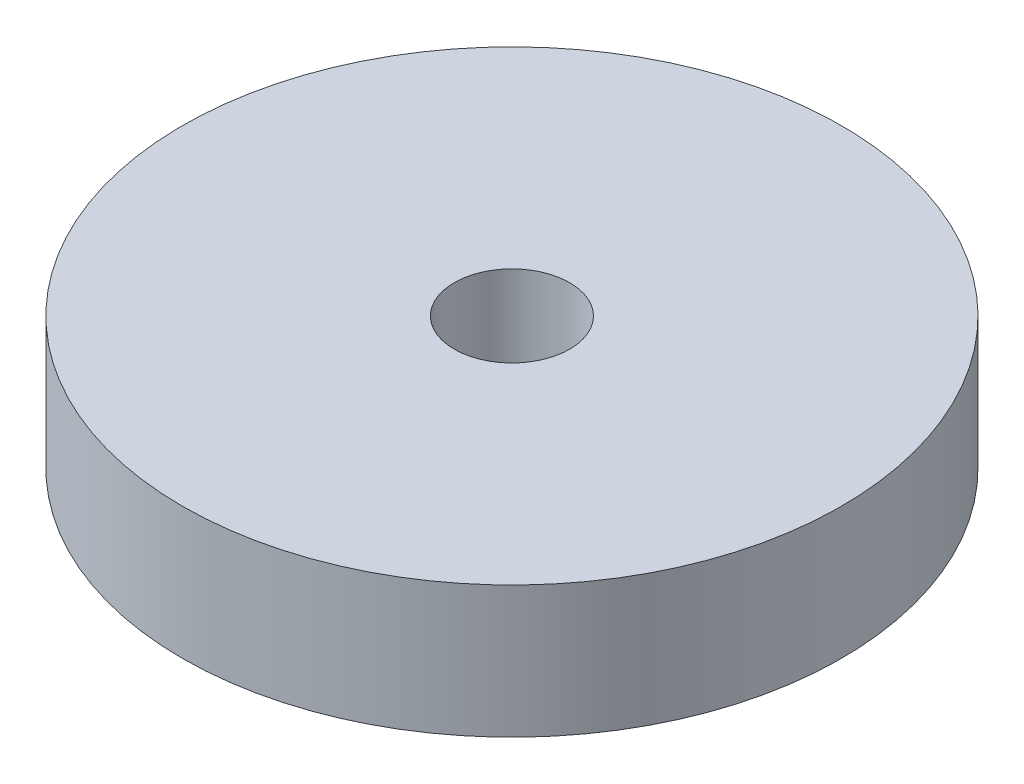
from build123d import *

# Parameters (mm, degrees)
SKETCH1_R      = 10
SKETCH1_R_2    = 1.75
EXTRUDE1_DEPTH = 4


with BuildPart() as part:
    # Sketch1 → Extrude1 (new body)
    with BuildSketch(Plane(origin=(0, 0, 0), x_dir=(1, 0, 0), z_dir=(0, 1, 0))):
        with Locations(Location((0, 0, 0), (0, 0, 270))):
            Circle(SKETCH1_R)
        with Locations(Location((0, 0, 0), (0, 0, 270))):
            Circle(SKETCH1_R_2, mode=Mode.SUBTRACT)
    extrude(amount=EXTRUDE1_DEPTH)


solid = part.part
